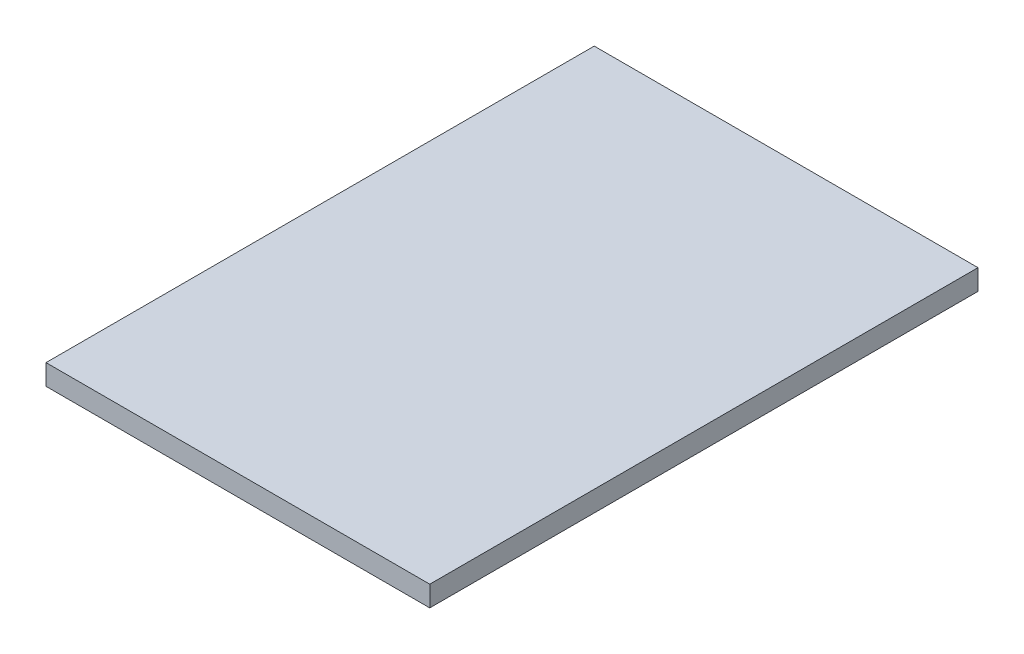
from build123d import *

# Parameters (mm, degrees)
SKETCH1_W           = 355.6
SKETCH1_H           = 508
BOSS_EXTRUDE1_DEPTH = 19.05


with BuildPart() as part:
    # Sketch1 → Boss-Extrude1 (new body)
    with BuildSketch(Plane(origin=(0, 0, 0), x_dir=(1, 0, 0), z_dir=(0, 1, 0))):
        with Locations((0, 254)):
            Rectangle(SKETCH1_W, SKETCH1_H)
    extrude(amount=BOSS_EXTRUDE1_DEPTH)


solid = part.part
